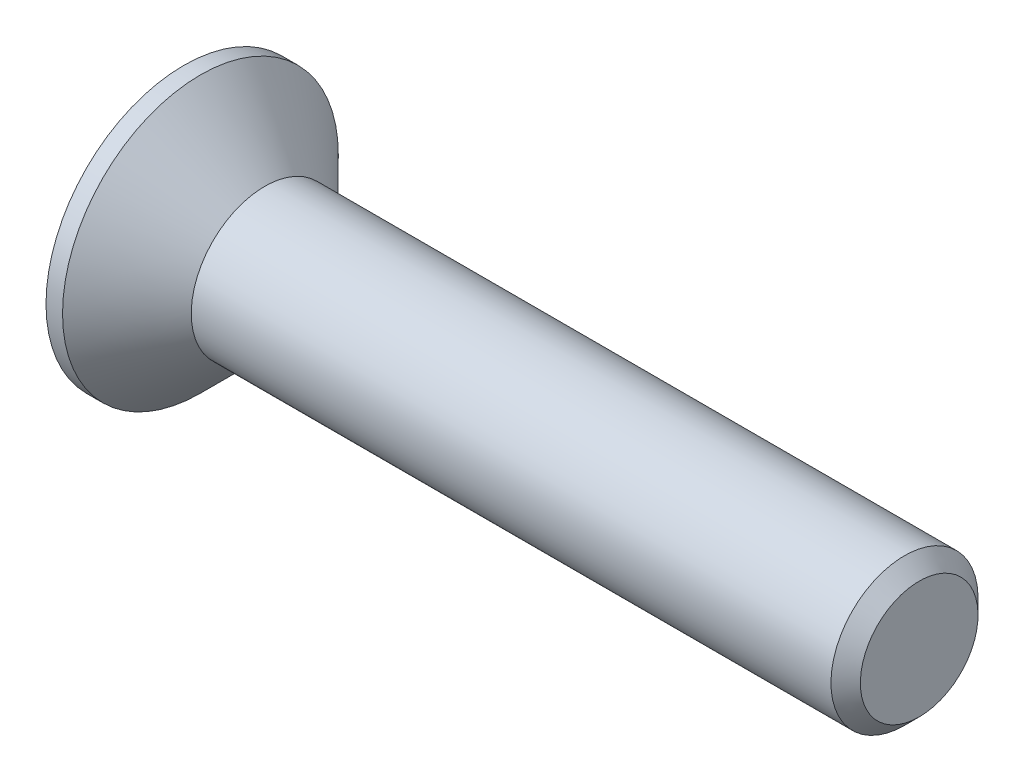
from build123d import *

# Parameters (mm, degrees)
CHAMFER1_SIZE      = 0.4
CUT_EXTRUDE1_DEPTH = 1.9


with BuildPart() as part:
    # Sketch1 → Revolve1 (revolve)
    with BuildSketch(Plane.XY, mode=Mode.PRIVATE) as revolve1_sk:
        Polygon((-2.2, 3.75), (-2.2, 0), (17.8, 0), (17.8, 2), (0, 2), (-1.75, 3.75), align=None)
    revolve(revolve1_sk.sketch.rotate(Axis((-2.2, 0, 0), (1, 0, 0)), 180), axis=Axis((-2.2, 0, 0), (1, 0, 0)))

    # Chamfer1
    chamfer1_edges = [part.edges().sort_by_distance(p)[0] for p in [
        (17.8, 2, 0),
    ]]
    chamfer(chamfer1_edges, length=CHAMFER1_SIZE)

    # Sketch2 → Cut-Extrude1 (cut)
    with BuildSketch(Plane.ZY.offset(2.2)):
        Polygon((-0.55, 2.2), (0.55, 2.2), (0.55, 0.55), (2.2, 0.55), (2.2, -0.55), (0.55, -0.55), (0.55, -2.2), (-0.55, -2.2), (-0.55, -0.55), (-2.2, -0.55), (-2.2, 0.55), (-0.55, 0.55), align=None)
    extrude(amount=-CUT_EXTRUDE1_DEPTH, mode=Mode.SUBTRACT)


solid = part.part
